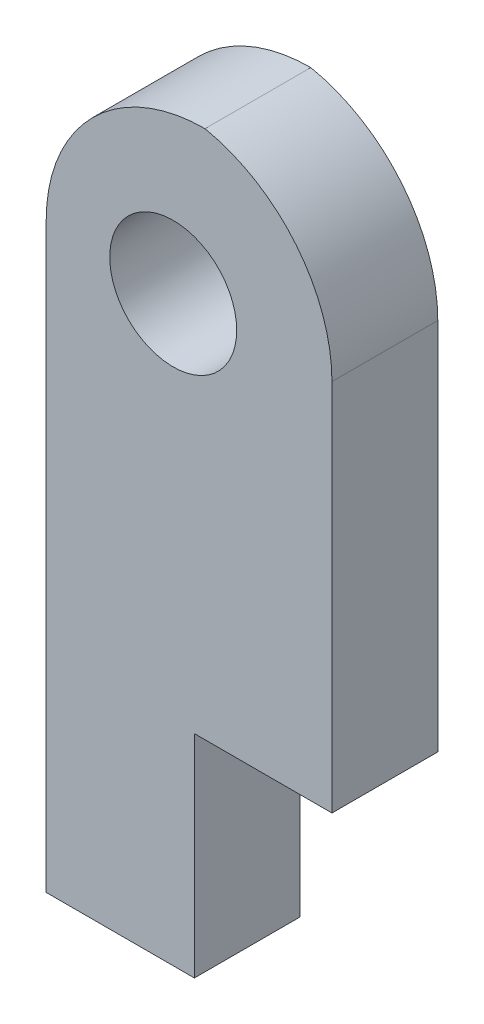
ISO-10303-21;
HEADER;
FILE_DESCRIPTION(('STEP AP214'),'2;1');
FILE_NAME('part.step','',(''),(''),'','','');
FILE_SCHEMA(('AUTOMOTIVE_DESIGN { 1 0 10303 214 1 1 1 1 }'));
ENDSEC;
DATA;
#1=APPLICATION_CONTEXT('core data for automotive mechanical design processes');
#2=APPLICATION_PROTOCOL_DEFINITION('international standard','automotive_design',2000,#1);
#3=PRODUCT_CONTEXT('',#1,'mechanical');
#4=PRODUCT('Part','Part','',(#3));
#5=PRODUCT_RELATED_PRODUCT_CATEGORY('part','',(#4));
#6=PRODUCT_DEFINITION_FORMATION('','',#4);
#7=PRODUCT_DEFINITION_CONTEXT('part definition',#1,'design');
#8=PRODUCT_DEFINITION('design','',#6,#7);
#9=PRODUCT_DEFINITION_SHAPE('','',#8);
#10=(LENGTH_UNIT() NAMED_UNIT(*) SI_UNIT(.MILLI.,.METRE.));
#11=(NAMED_UNIT(*) PLANE_ANGLE_UNIT() SI_UNIT($,.RADIAN.));
#12=(NAMED_UNIT(*) SI_UNIT($,.STERADIAN.) SOLID_ANGLE_UNIT());
#13=UNCERTAINTY_MEASURE_WITH_UNIT(LENGTH_MEASURE(1.E-05),#10,'distance_accuracy_value','');
#14=(GEOMETRIC_REPRESENTATION_CONTEXT(3) GLOBAL_UNCERTAINTY_ASSIGNED_CONTEXT((#13)) GLOBAL_UNIT_ASSIGNED_CONTEXT((#10,
#11,#12)) REPRESENTATION_CONTEXT('',''));
#15=CARTESIAN_POINT('',(0.,0.,0.));
#16=DIRECTION('',(0.,0.,1.));
#17=DIRECTION('',(1.,0.,0.));
#18=AXIS2_PLACEMENT_3D('',#15,#16,#17);
#19=CARTESIAN_POINT('',(-27.,70.,10.));
#20=DIRECTION('',(0.,0.,-1.));
#21=DIRECTION('',(-1.,0.,0.));
#22=AXIS2_PLACEMENT_3D('',#19,#20,#21);
#23=PLANE('',#22);
#24=DIRECTION('',(0.,1.,0.));
#25=VECTOR('',#24,1.);
#26=CARTESIAN_POINT('',(0.,20.,10.));
#27=LINE('',#26,#25);
#28=CARTESIAN_POINT('',(0.,20.,10.));
#29=VERTEX_POINT('',#28);
#30=CARTESIAN_POINT('',(0.,55.3030615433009,10.));
#31=VERTEX_POINT('',#30);
#32=EDGE_CURVE('E146',#29,#31,#27,.T.);
#33=ORIENTED_EDGE('',*,*,#32,.T.);
#34=CARTESIAN_POINT('',(-15.,55.3030615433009,10.));
#35=DIRECTION('',(0.,0.,-1.));
#36=DIRECTION('',(-1.,0.,0.));
#37=AXIS2_PLACEMENT_3D('',#34,#35,#36);
#38=CIRCLE('',#37,15.);
#39=CARTESIAN_POINT('',(-12.,70.,10.));
#40=VERTEX_POINT('',#39);
#41=EDGE_CURVE('E11',#31,#40,#38,.F.);
#42=ORIENTED_EDGE('',*,*,#41,.T.);
#43=CARTESIAN_POINT('',(-12.,55.,10.));
#44=DIRECTION('',(0.,0.,-1.));
#45=DIRECTION('',(-1.,0.,0.));
#46=AXIS2_PLACEMENT_3D('',#43,#44,#45);
#47=CIRCLE('',#46,15.);
#48=CARTESIAN_POINT('',(-27.,55.,10.));
#49=VERTEX_POINT('',#48);
#50=EDGE_CURVE('E96',#40,#49,#47,.F.);
#51=ORIENTED_EDGE('',*,*,#50,.T.);
#52=DIRECTION('',(0.,-1.,0.));
#53=VECTOR('',#52,1.);
#54=CARTESIAN_POINT('',(-27.,0.,10.));
#55=LINE('',#54,#53);
#56=CARTESIAN_POINT('',(-27.,0.,10.));
#57=VERTEX_POINT('',#56);
#58=EDGE_CURVE('E90',#49,#57,#55,.T.);
#59=ORIENTED_EDGE('',*,*,#58,.T.);
#60=DIRECTION('',(1.,0.,0.));
#61=VECTOR('',#60,1.);
#62=CARTESIAN_POINT('',(-27.,0.,10.));
#63=LINE('',#62,#61);
#64=CARTESIAN_POINT('',(-13.,0.,10.));
#65=VERTEX_POINT('',#64);
#66=EDGE_CURVE('E93',#57,#65,#63,.T.);
#67=ORIENTED_EDGE('',*,*,#66,.T.);
#68=DIRECTION('',(0.,1.,0.));
#69=VECTOR('',#68,1.);
#70=CARTESIAN_POINT('',(-13.,0.,10.));
#71=LINE('',#70,#69);
#72=CARTESIAN_POINT('',(-13.,20.,10.));
#73=VERTEX_POINT('',#72);
#74=EDGE_CURVE('E110',#65,#73,#71,.T.);
#75=ORIENTED_EDGE('',*,*,#74,.T.);
#76=DIRECTION('',(1.,0.,0.));
#77=VECTOR('',#76,1.);
#78=CARTESIAN_POINT('',(-13.,20.,10.));
#79=LINE('',#78,#77);
#80=EDGE_CURVE('E162',#73,#29,#79,.T.);
#81=ORIENTED_EDGE('',*,*,#80,.T.);
#82=EDGE_LOOP('',(#33,#42,#51,#59,#67,#75,#81));
#83=FACE_BOUND('',#82,.T.);
#84=CARTESIAN_POINT('',(-15.,55.,10.));
#85=DIRECTION('',(0.,0.,1.));
#86=DIRECTION('',(1.,0.,0.));
#87=AXIS2_PLACEMENT_3D('',#84,#85,#86);
#88=CIRCLE('',#87,6.);
#89=CARTESIAN_POINT('',(-9.,55.,10.));
#90=VERTEX_POINT('',#89);
#91=EDGE_CURVE('E138',#90,#90,#88,.T.);
#92=ORIENTED_EDGE('',*,*,#91,.F.);
#93=EDGE_LOOP('',(#92));
#94=FACE_BOUND('',#93,.T.);
#95=ADVANCED_FACE('F32',(#83,#94),#23,.F.);
#96=CARTESIAN_POINT('',(-27.,70.,0.));
#97=DIRECTION('',(0.,0.,-1.));
#98=DIRECTION('',(-1.,0.,0.));
#99=AXIS2_PLACEMENT_3D('',#96,#97,#98);
#100=PLANE('',#99);
#101=CARTESIAN_POINT('',(-12.,55.,0.));
#102=DIRECTION('',(0.,0.,-1.));
#103=DIRECTION('',(-1.,0.,0.));
#104=AXIS2_PLACEMENT_3D('',#101,#102,#103);
#105=CIRCLE('',#104,15.);
#106=CARTESIAN_POINT('',(-27.,55.,0.));
#107=VERTEX_POINT('',#106);
#108=CARTESIAN_POINT('',(-12.,70.,0.));
#109=VERTEX_POINT('',#108);
#110=EDGE_CURVE('E118',#107,#109,#105,.T.);
#111=ORIENTED_EDGE('',*,*,#110,.T.);
#112=CARTESIAN_POINT('',(-15.,55.3030615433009,0.));
#113=DIRECTION('',(0.,0.,-1.));
#114=DIRECTION('',(-1.,0.,0.));
#115=AXIS2_PLACEMENT_3D('',#112,#113,#114);
#116=CIRCLE('',#115,15.);
#117=CARTESIAN_POINT('',(0.,55.3030615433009,0.));
#118=VERTEX_POINT('',#117);
#119=EDGE_CURVE('E54',#109,#118,#116,.T.);
#120=ORIENTED_EDGE('',*,*,#119,.T.);
#121=DIRECTION('',(0.,1.,0.));
#122=VECTOR('',#121,1.);
#123=CARTESIAN_POINT('',(0.,20.,0.));
#124=LINE('',#123,#122);
#125=CARTESIAN_POINT('',(0.,20.,0.));
#126=VERTEX_POINT('',#125);
#127=EDGE_CURVE('E101',#126,#118,#124,.T.);
#128=ORIENTED_EDGE('',*,*,#127,.F.);
#129=DIRECTION('',(1.,0.,0.));
#130=VECTOR('',#129,1.);
#131=CARTESIAN_POINT('',(-13.,20.,0.));
#132=LINE('',#131,#130);
#133=CARTESIAN_POINT('',(-13.,20.,0.));
#134=VERTEX_POINT('',#133);
#135=EDGE_CURVE('E150',#134,#126,#132,.T.);
#136=ORIENTED_EDGE('',*,*,#135,.F.);
#137=DIRECTION('',(0.,1.,0.));
#138=VECTOR('',#137,1.);
#139=CARTESIAN_POINT('',(-13.,0.,0.));
#140=LINE('',#139,#138);
#141=CARTESIAN_POINT('',(-13.,0.,0.));
#142=VERTEX_POINT('',#141);
#143=EDGE_CURVE('E140',#142,#134,#140,.T.);
#144=ORIENTED_EDGE('',*,*,#143,.F.);
#145=DIRECTION('',(1.,0.,0.));
#146=VECTOR('',#145,1.);
#147=CARTESIAN_POINT('',(-27.,0.,0.));
#148=LINE('',#147,#146);
#149=CARTESIAN_POINT('',(-27.,0.,0.));
#150=VERTEX_POINT('',#149);
#151=EDGE_CURVE('E137',#150,#142,#148,.T.);
#152=ORIENTED_EDGE('',*,*,#151,.F.);
#153=DIRECTION('',(0.,-1.,0.));
#154=VECTOR('',#153,1.);
#155=CARTESIAN_POINT('',(-27.,0.,0.));
#156=LINE('',#155,#154);
#157=EDGE_CURVE('E114',#107,#150,#156,.T.);
#158=ORIENTED_EDGE('',*,*,#157,.F.);
#159=EDGE_LOOP('',(#111,#120,#128,#136,#144,#152,#158));
#160=FACE_BOUND('',#159,.T.);
#161=CARTESIAN_POINT('',(-15.,55.,0.));
#162=DIRECTION('',(0.,0.,1.));
#163=DIRECTION('',(1.,0.,0.));
#164=AXIS2_PLACEMENT_3D('',#161,#162,#163);
#165=CIRCLE('',#164,6.);
#166=CARTESIAN_POINT('',(-9.,55.,0.));
#167=VERTEX_POINT('',#166);
#168=EDGE_CURVE('E143',#167,#167,#165,.T.);
#169=ORIENTED_EDGE('',*,*,#168,.T.);
#170=EDGE_LOOP('',(#169));
#171=FACE_BOUND('',#170,.T.);
#172=ADVANCED_FACE('F134',(#160,#171),#100,.T.);
#173=CARTESIAN_POINT('',(-27.,0.,10.));
#174=DIRECTION('',(1.,0.,0.));
#175=DIRECTION('',(0.,0.,-1.));
#176=AXIS2_PLACEMENT_3D('',#173,#174,#175);
#177=PLANE('',#176);
#178=ORIENTED_EDGE('',*,*,#58,.F.);
#179=DIRECTION('',(0.,0.,-1.));
#180=VECTOR('',#179,1.);
#181=CARTESIAN_POINT('',(-27.,55.,10.));
#182=LINE('',#181,#180);
#183=EDGE_CURVE('E116',#49,#107,#182,.T.);
#184=ORIENTED_EDGE('',*,*,#183,.T.);
#185=ORIENTED_EDGE('',*,*,#157,.T.);
#186=DIRECTION('',(0.,0.,-1.));
#187=VECTOR('',#186,1.);
#188=CARTESIAN_POINT('',(-27.,0.,10.));
#189=LINE('',#188,#187);
#190=EDGE_CURVE('E106',#57,#150,#189,.T.);
#191=ORIENTED_EDGE('',*,*,#190,.F.);
#192=EDGE_LOOP('',(#178,#184,#185,#191));
#193=FACE_BOUND('',#192,.T.);
#194=ADVANCED_FACE('F112',(#193),#177,.F.);
#195=CARTESIAN_POINT('',(-27.,0.,10.));
#196=DIRECTION('',(0.,1.,0.));
#197=DIRECTION('',(0.,0.,1.));
#198=AXIS2_PLACEMENT_3D('',#195,#196,#197);
#199=PLANE('',#198);
#200=ORIENTED_EDGE('',*,*,#151,.T.);
#201=DIRECTION('',(0.,0.,-1.));
#202=VECTOR('',#201,1.);
#203=CARTESIAN_POINT('',(-13.,0.,10.));
#204=LINE('',#203,#202);
#205=EDGE_CURVE('E108',#65,#142,#204,.T.);
#206=ORIENTED_EDGE('',*,*,#205,.F.);
#207=ORIENTED_EDGE('',*,*,#66,.F.);
#208=ORIENTED_EDGE('',*,*,#190,.T.);
#209=EDGE_LOOP('',(#200,#206,#207,#208));
#210=FACE_BOUND('',#209,.T.);
#211=ADVANCED_FACE('F105',(#210),#199,.F.);
#212=CARTESIAN_POINT('',(-13.,0.,10.));
#213=DIRECTION('',(-1.,0.,0.));
#214=DIRECTION('',(0.,0.,1.));
#215=AXIS2_PLACEMENT_3D('',#212,#213,#214);
#216=PLANE('',#215);
#217=ORIENTED_EDGE('',*,*,#143,.T.);
#218=DIRECTION('',(0.,0.,-1.));
#219=VECTOR('',#218,1.);
#220=CARTESIAN_POINT('',(-13.,20.,10.));
#221=LINE('',#220,#219);
#222=EDGE_CURVE('E120',#73,#134,#221,.T.);
#223=ORIENTED_EDGE('',*,*,#222,.F.);
#224=ORIENTED_EDGE('',*,*,#74,.F.);
#225=ORIENTED_EDGE('',*,*,#205,.T.);
#226=EDGE_LOOP('',(#217,#223,#224,#225));
#227=FACE_BOUND('',#226,.T.);
#228=ADVANCED_FACE('F188',(#227),#216,.F.);
#229=CARTESIAN_POINT('',(-13.,20.,10.));
#230=DIRECTION('',(0.,1.,0.));
#231=DIRECTION('',(0.,0.,1.));
#232=AXIS2_PLACEMENT_3D('',#229,#230,#231);
#233=PLANE('',#232);
#234=ORIENTED_EDGE('',*,*,#135,.T.);
#235=DIRECTION('',(0.,0.,-1.));
#236=VECTOR('',#235,1.);
#237=CARTESIAN_POINT('',(0.,20.,10.));
#238=LINE('',#237,#236);
#239=EDGE_CURVE('E153',#29,#126,#238,.T.);
#240=ORIENTED_EDGE('',*,*,#239,.F.);
#241=ORIENTED_EDGE('',*,*,#80,.F.);
#242=ORIENTED_EDGE('',*,*,#222,.T.);
#243=EDGE_LOOP('',(#234,#240,#241,#242));
#244=FACE_BOUND('',#243,.T.);
#245=ADVANCED_FACE('F160',(#244),#233,.F.);
#246=CARTESIAN_POINT('',(0.,20.,10.));
#247=DIRECTION('',(-1.,0.,0.));
#248=DIRECTION('',(0.,-1.,0.));
#249=AXIS2_PLACEMENT_3D('',#246,#247,#248);
#250=PLANE('',#249);
#251=ORIENTED_EDGE('',*,*,#127,.T.);
#252=DIRECTION('',(0.,0.,-1.));
#253=VECTOR('',#252,1.);
#254=CARTESIAN_POINT('',(0.,55.3030615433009,10.));
#255=LINE('',#254,#253);
#256=EDGE_CURVE('E40',#118,#31,#255,.F.);
#257=ORIENTED_EDGE('',*,*,#256,.T.);
#258=ORIENTED_EDGE('',*,*,#32,.F.);
#259=ORIENTED_EDGE('',*,*,#239,.T.);
#260=EDGE_LOOP('',(#251,#257,#258,#259));
#261=FACE_BOUND('',#260,.T.);
#262=ADVANCED_FACE('F164',(#261),#250,.F.);
#263=CARTESIAN_POINT('',(-15.,55.,10.));
#264=DIRECTION('',(0.,0.,-1.));
#265=DIRECTION('',(-1.,0.,0.));
#266=AXIS2_PLACEMENT_3D('',#263,#264,#265);
#267=CYLINDRICAL_SURFACE('',#266,6.);
#268=ORIENTED_EDGE('',*,*,#91,.T.);
#269=EDGE_LOOP('',(#268));
#270=FACE_BOUND('',#269,.T.);
#271=ORIENTED_EDGE('',*,*,#168,.F.);
#272=EDGE_LOOP('',(#271));
#273=FACE_BOUND('',#272,.T.);
#274=ADVANCED_FACE('F170',(#270,#273),#267,.F.);
#275=CARTESIAN_POINT('',(-12.,55.,10.));
#276=DIRECTION('',(0.,0.,-1.));
#277=DIRECTION('',(-1.,0.,0.));
#278=AXIS2_PLACEMENT_3D('',#275,#276,#277);
#279=CYLINDRICAL_SURFACE('',#278,15.);
#280=ORIENTED_EDGE('',*,*,#50,.F.);
#281=DIRECTION('',(0.,0.,-1.));
#282=VECTOR('',#281,1.);
#283=CARTESIAN_POINT('',(-12.,70.,10.));
#284=LINE('',#283,#282);
#285=EDGE_CURVE('E125',#109,#40,#284,.F.);
#286=ORIENTED_EDGE('',*,*,#285,.F.);
#287=ORIENTED_EDGE('',*,*,#110,.F.);
#288=ORIENTED_EDGE('',*,*,#183,.F.);
#289=EDGE_LOOP('',(#280,#286,#287,#288));
#290=FACE_BOUND('',#289,.T.);
#291=ADVANCED_FACE('F133',(#290),#279,.T.);
#292=CARTESIAN_POINT('',(-15.,55.3030615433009,10.));
#293=DIRECTION('',(0.,0.,-1.));
#294=DIRECTION('',(-1.,0.,0.));
#295=AXIS2_PLACEMENT_3D('',#292,#293,#294);
#296=CYLINDRICAL_SURFACE('',#295,15.);
#297=ORIENTED_EDGE('',*,*,#41,.F.);
#298=ORIENTED_EDGE('',*,*,#256,.F.);
#299=ORIENTED_EDGE('',*,*,#119,.F.);
#300=ORIENTED_EDGE('',*,*,#285,.T.);
#301=EDGE_LOOP('',(#297,#298,#299,#300));
#302=FACE_BOUND('',#301,.T.);
#303=ADVANCED_FACE('F34',(#302),#296,.T.);
#304=CLOSED_SHELL('',(#95,#172,#194,#211,#228,#245,#262,#274,#291,#303));
#305=MANIFOLD_SOLID_BREP('B2',#304);
#306=ADVANCED_BREP_SHAPE_REPRESENTATION('',(#18,#305),#14);
#307=SHAPE_DEFINITION_REPRESENTATION(#9,#306);
ENDSEC;
END-ISO-10303-21;
